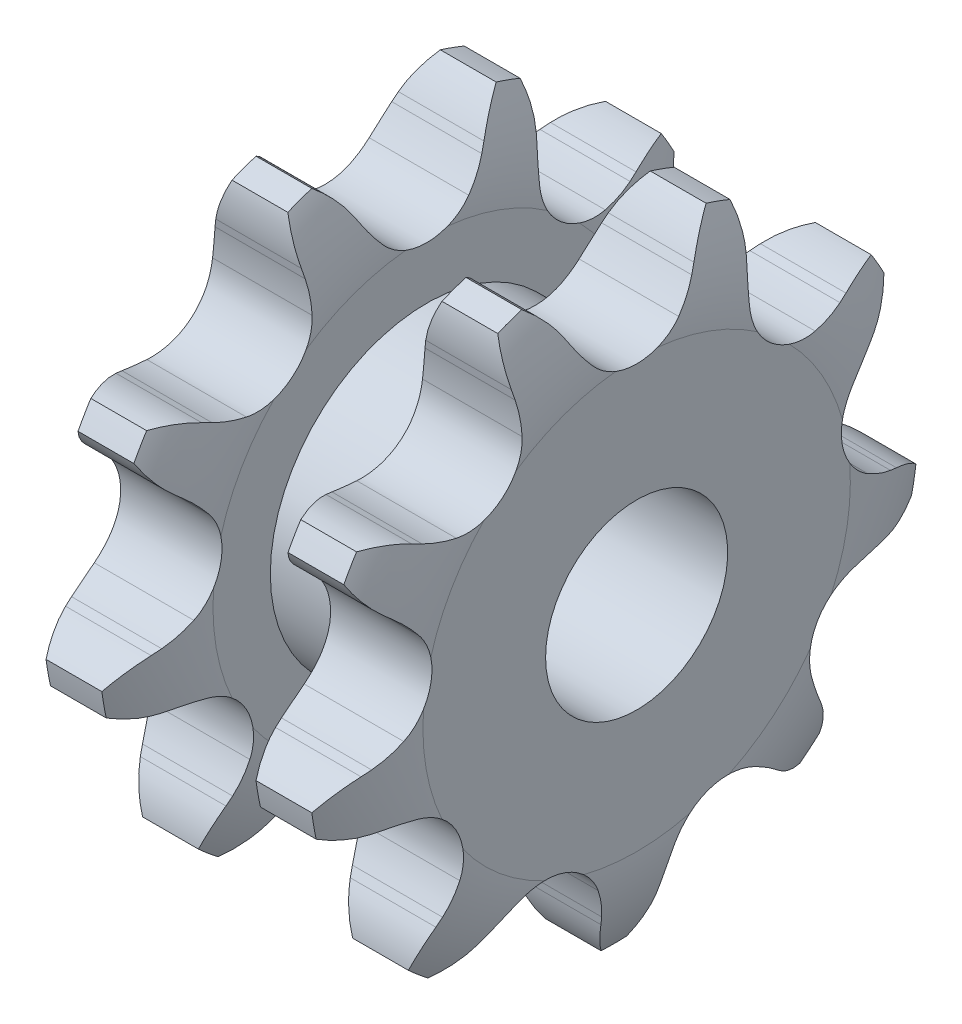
from build123d import *

# Parameters (mm, degrees)
TOOTHCUT_DEPTH  = 75.162749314
TEETHCUTS_COUNT = 9
TEETHCUTS_ANGLE = 320
BORSKE_R        = 12.7
BORE_DEPTH      = 50.8000508


with BuildPart() as part:
    # BasProSke → Base-Revolve (revolve)
    with BuildSketch(Plane(origin=(0, 0, 0), x_dir=(1, 0, 0), z_dir=(0, 1, 0)), mode=Mode.PRIVATE) as base_revolve_sk:
        with BuildLine():
            Line((0, 0), (0, 29.81296327))
            ThreePointArc((0, 29.81296327), (0.805779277, 36.358393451), (3.175, 42.51296327))
            Line((3.175, 42.51296327), (40.2463, 42.51296327))
            ThreePointArc((40.2463, 42.51296327), (42.615520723, 36.358393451), (43.4213, 29.81296327))
            Line((43.4213, 29.81296327), (43.4213, 0))
            Line((43.4213, 0), (0, 0))
        make_face()
    revolve(base_revolve_sk.sketch.rotate(Axis((-10, 0, 0), (1, 0, 0)), 180), axis=Axis((-10, 0, 0), (1, 0, 0)))

    # GrvSke → Groove (revolve, cut)
    with BuildSketch(Plane(origin=(0, 0, 0), x_dir=(1, 0, 0), z_dir=(0, 1, 0)), mode=Mode.PRIVATE) as groove_sk:
        with BuildLine():
            Line((14.1351, 29.81296327), (14.1351, 21.81196327))
            Line((14.1351, 21.81196327), (29.2862, 21.81196327))
            Line((29.2862, 21.81196327), (29.2862, 29.81296327))
            ThreePointArc((29.2862, 29.81296327), (30.091979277, 36.358393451), (32.4612, 42.51296327))
            Line((32.4612, 42.51296327), (10.9601, 42.51296327))
            ThreePointArc((10.9601, 42.51296327), (13.329320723, 36.358393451), (14.1351, 29.81296327))
        make_face()
    revolve(groove_sk.sketch.rotate(Axis((0, 0, 0), (1, 0, 0)), 180), axis=Axis((0, 0, 0), (1, 0, 0)), mode=Mode.SUBTRACT)

    # TooCutSke → ToothCut (cut, through all)
    with BuildSketch(Plane(origin=(0, 0, 0), x_dir=(0, 0, -1), z_dir=(1, 0, 0))):
        with BuildLine():
            Line((8.47279918, 35.252389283), (9.083041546, 36.314109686))
            ThreePointArc((9.083041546, 36.314109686), (14.067176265, 41.312763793), (20.8846685, 43.143048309))
            ThreePointArc((20.8846685, 43.143048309), (0, 47.93216035), (-20.8846685, 43.143048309))
            ThreePointArc((-20.8846685, 43.143048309), (-14.067176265, 41.312763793), (-9.083041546, 36.314109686))
            Line((-9.083041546, 36.314109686), (-8.47279918, 35.252389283))
            ThreePointArc((-8.47279918, 35.252389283), (-7.318900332, 33.464174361), (-5.987620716, 31.803785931))
            ThreePointArc((-5.987620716, 31.803785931), (0, 29.117028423), (5.987620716, 31.803785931))
            ThreePointArc((5.987620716, 31.803785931), (7.318900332, 33.464174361), (8.47279918, 35.252389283))
        make_face()
    toothcut = extrude(amount=TOOTHCUT_DEPTH, mode=Mode.SUBTRACT)

    # TeethCuts: ToothCut ×9 about axis
    teethcuts_axis = Axis((-10, 0, 0), (1, 0, 0))
    for i in range(1, TEETHCUTS_COUNT):
        add(toothcut.rotate(teethcuts_axis, i * TEETHCUTS_ANGLE / (TEETHCUTS_COUNT - 1)), mode=Mode.SUBTRACT)

    # BorSke → Bore (cut, symmetric)
    with BuildSketch(Plane(origin=(0, 0, 0), x_dir=(0, 0, -1), z_dir=(1, 0, 0))):
        with Locations(Location((0, 0, 0), (0, 0, 180))):
            Circle(BORSKE_R)
    extrude(amount=BORE_DEPTH, both=True, mode=Mode.SUBTRACT)


solid = part.part
